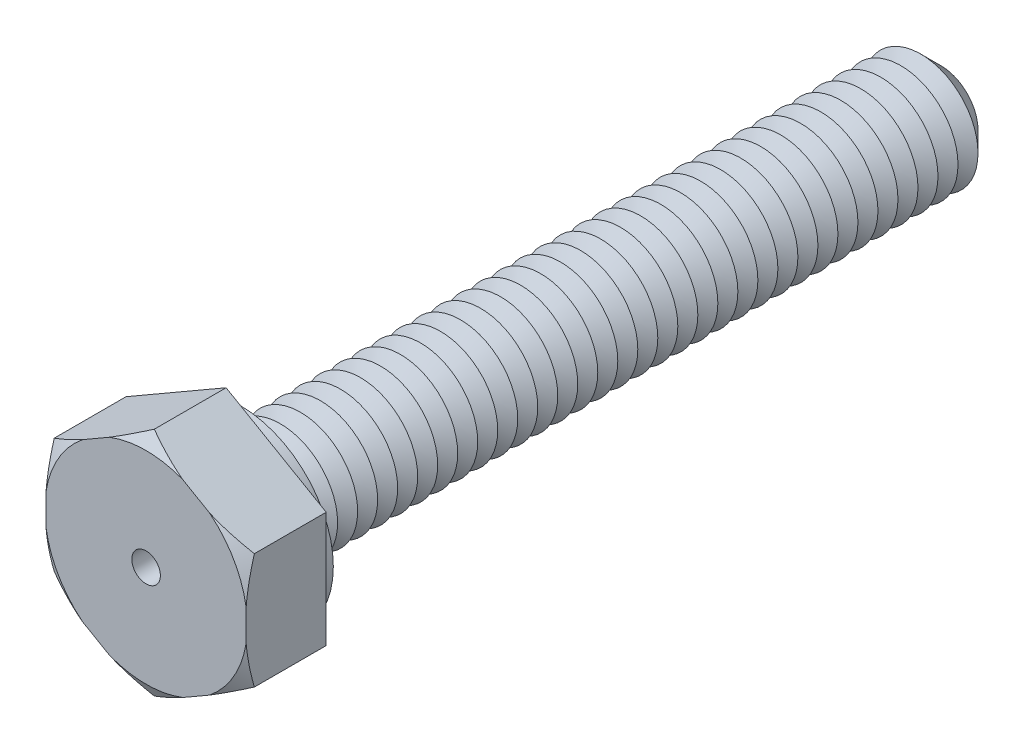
from build123d import *

# Parameters (mm, degrees)
BOSS_EXTRUDE1_DEPTH = 2.8
SKETCH3_R           = 2
BOSS_EXTRUDE2_DEPTH = 25
SKETCH4_R           = 3.25
BOSS_EXTRUDE3_DEPTH = 0.5
CHAMFER1_SIZE       = 0.7
LPATTERN1_COUNT     = 34
LPATTERN1_PITCH     = 0.7
SKETCH8_R           = 0.5
CUT_EXTRUDE1_DEPTH  = 27.8


with BuildPart() as part:
    # Sketch2 → Boss-Extrude1 (new body)
    with BuildSketch(Plane.XY):
        Polygon((0, 4.041451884), (-3.5, 2.020725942), (-3.5, -2.020725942), (0, -4.041451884), (3.5, -2.020725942), (3.5, 2.020725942), align=None)
    extrude(amount=BOSS_EXTRUDE1_DEPTH)

    # Sketch3 → Boss-Extrude2 (add)
    with BuildSketch(Plane(origin=(0, 0, 0), x_dir=(-1, 0, 0), z_dir=(0, 0, -1))):
        Circle(SKETCH3_R)
    extrude(amount=BOSS_EXTRUDE2_DEPTH)

    # Sketch4 → Boss-Extrude3 (add)
    with BuildSketch(Plane(origin=(0, 0, 0), x_dir=(-1, 0, 0), z_dir=(0, 0, -1))):
        with Locations(Location((0, 0, 0), (0, 0, 180))):
            Circle(SKETCH4_R)
    extrude(amount=BOSS_EXTRUDE3_DEPTH)

    # Chamfer1
    chamfer1_edges = [part.edges().sort_by_distance(p)[0] for p in [
        (2, 0, -25),
    ]]
    chamfer(chamfer1_edges, length=CHAMFER1_SIZE)

    # Sketch6 → Cut-Revolve1 (revolve, cut)
    with BuildSketch(Plane(origin=(0, 0, 0), x_dir=(0, 0, -1), z_dir=(1, 0, 0)), mode=Mode.PRIVATE) as cut_revolve1_sk:
        Polygon((0.5, 2), (0.85, 1.393782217), (1.2, 2), align=None)
    cut_revolve1 = revolve(cut_revolve1_sk.sketch.rotate(Axis((0, 0, 3.211670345), (0, 0, -1)), 90), axis=Axis((0, 0, 3.211670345), (0, 0, -1)), mode=Mode.SUBTRACT)

    # LPattern1: Cut-Revolve1 ×34
    with Locations(*[(0, 0, -i * LPATTERN1_PITCH) for i in range(1, LPATTERN1_COUNT)]):
        add(cut_revolve1, mode=Mode.SUBTRACT)

    # Sketch7 → Cut-Revolve2 (revolve, cut)
    with BuildSketch(Plane(origin=(0, 0, 0), x_dir=(0, 0, -1), z_dir=(1, 0, 0)), mode=Mode.PRIVATE) as cut_revolve2_sk:
        Polygon((-2.8, 4.041451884), (-2.8, 3.541451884), (-2.511324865, 4.041451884), align=None)
    revolve(cut_revolve2_sk.sketch.rotate(Axis((0, 0, 3.211670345), (0, 0, -1)), 90), axis=Axis((0, 0, 3.211670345), (0, 0, -1)), mode=Mode.SUBTRACT)

    # Sketch8 → Cut-Extrude1 (cut)
    with BuildSketch(Plane.XY.offset(2.8)):
        Circle(SKETCH8_R)
    extrude(amount=-CUT_EXTRUDE1_DEPTH, mode=Mode.SUBTRACT)


solid = part.part
